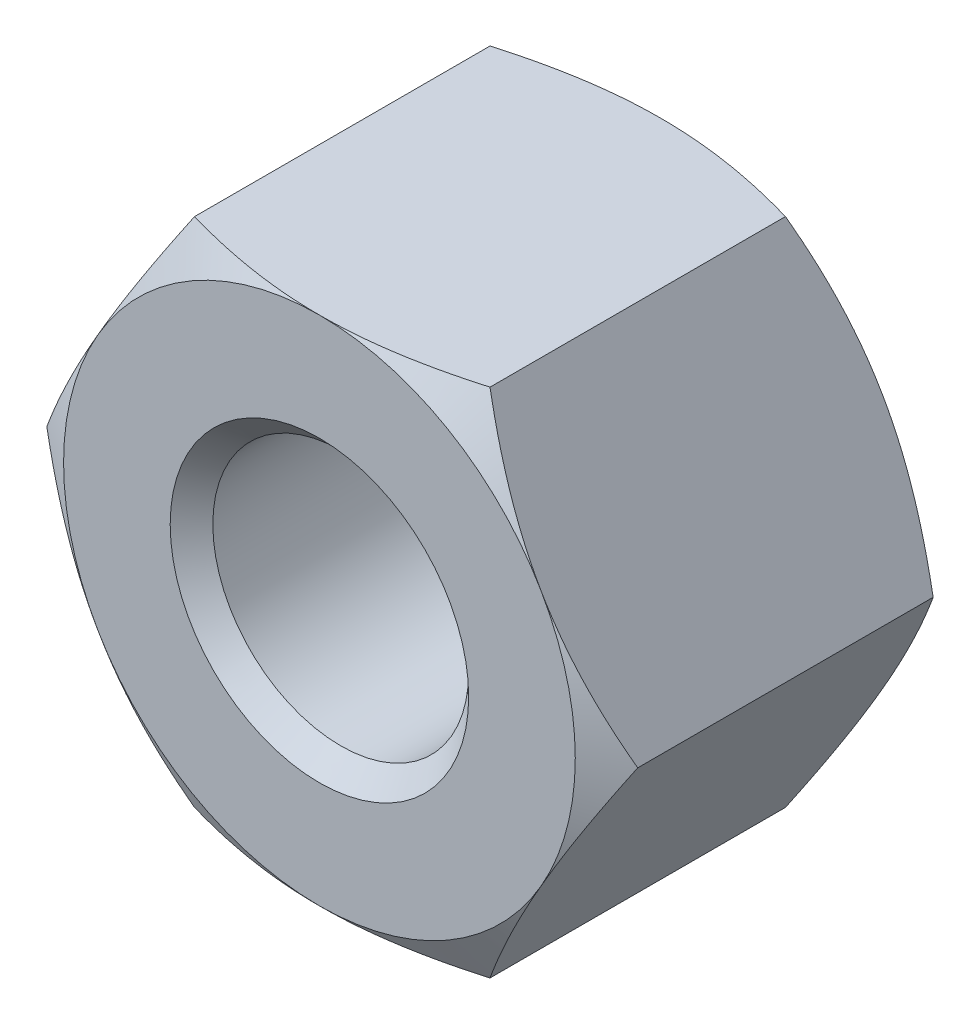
from build123d import *

# Parameters (mm, degrees)
BOSS_EXTRUDE1_DEPTH      = 2
SKETCH2_OUTSIDE_W        = 31.588
SKETCH2_OUTSIDE_H        = 30.66
SKETCH2_OUTSIDE_R        = 3
CUT_EXTRUDE1_DEPTH       = 6
CUT_EXTRUDE1_DRAFT       = -60
SKETCH3_R                = 1.5
SKETCH3_R_2              = 1.25
CUT_EXTRUDE2_DEPTH       = 2
SKETCH3_2_R              = 1.25
CUT_EXTRUDE3_DEPTH       = 2.75
CHAMFER1_SIZE            = 0.25
MIRROR1_COPY_1_SKETCH_W  = 31.588
MIRROR1_COPY_1_SKETCH_H  = 30.66
MIRROR1_COPY_1_SKETCH_R  = 3
MIRROR1_COPY_1_DEPTH     = 6
MIRROR1_COPY_1_DRAFT     = -60
CHAMFER1_OF_MIRROR1_SIZE = 0.25


with BuildPart() as part:
    # Sketch1 → Boss-Extrude1 (new body)
    with BuildSketch(Plane.XY):
        Polygon((1.732050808, 3), (-1.732050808, 3), (-3.464101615, 0), (-1.732050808, -3), (1.732050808, -3), (3.464101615, 0), align=None)
    boss_extrude1 = extrude(amount=-BOSS_EXTRUDE1_DEPTH)


with BuildPart() as cut_extrude1_tool:
    # Sketch2 outside → Cut-Extrude1 (with draft: the straight prism first)
    with BuildSketch(Plane(origin=(0, 0, -2), x_dir=(-1, 0, 0), z_dir=(0, 0, -1))):
        Rectangle(SKETCH2_OUTSIDE_W, SKETCH2_OUTSIDE_H)
        Circle(SKETCH2_OUTSIDE_R, mode=Mode.SUBTRACT)
    extrude(amount=-CUT_EXTRUDE1_DEPTH)
    # Cut-Extrude1: the draft: its side faces are tilted about the plane it starts from
    cut_extrude1_sides = [cut_extrude1_tool.faces().sort_by_distance(p)[0] for p in [
        (0, -15.33, 1),
        (-15.794, 0, 1),
        (0, 15.33, 1),
        (15.794, 0, 1),
        (3, 0, 1),
    ]]
    draft(cut_extrude1_sides, Plane(origin=(0, 0, -2), x_dir=(-1, 0, 0), z_dir=(0, 0, -1)), CUT_EXTRUDE1_DRAFT)


with BuildPart() as part_1:
    add(part.part)

    # Cut-Extrude1: cut by cut_extrude1_tool
    add(cut_extrude1_tool.part, mode=Mode.SUBTRACT)

    # Sketch3 → Cut-Extrude2 (cut)
    with BuildSketch(Plane(origin=(0, 0, -2), x_dir=(-1, 0, 0), z_dir=(0, 0, -1))):
        Circle(SKETCH3_R)
        Circle(SKETCH3_R_2, mode=Mode.SUBTRACT)
    cut_extrude2 = extrude(amount=-CUT_EXTRUDE2_DEPTH, mode=Mode.SUBTRACT)


with BuildPart() as cut_extrude2_piece_1:
    # of the separate pieces the step leaves, piece 1, a body of its own (cut_extrude2_pieces)
    add(part_1.part.solids().sort_by_distance((1.732050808, 3, 0))[0])

    # Chamfer1
    chamfer1_edges = [cut_extrude2_piece_1.edges().sort_by_distance(p)[0] for p in [
        (1.5, 0, -2),
    ]]
    chamfer(chamfer1_edges, length=CHAMFER1_SIZE)


with BuildPart() as cut_extrude2_piece_2:
    # of the separate pieces the step leaves, piece 2, a body of its own (cut_extrude2_pieces)
    add(part_1.part.solids().sort_by_distance((-1.25, 0, 0))[0])

    # Sketch3_2 → Cut-Extrude3 (cut)
    with BuildSketch(Plane(origin=(0, 0, -2), x_dir=(-1, 0, 0), z_dir=(0, 0, -1))):
        Circle(SKETCH3_2_R)
    cut_extrude3 = extrude(amount=-CUT_EXTRUDE3_DEPTH, mode=Mode.SUBTRACT)


with BuildPart() as cut_extrude2_piece_1_1:
    add(cut_extrude2_piece_1.part)

    # Mirror1: Boss-Extrude1, Cut-Extrude2, Cut-Extrude3 across plane
    add(boss_extrude1.mirror(Plane.XY))
    add(cut_extrude2.mirror(Plane.XY), mode=Mode.SUBTRACT)
    add(cut_extrude3.mirror(Plane.XY), mode=Mode.SUBTRACT)


with BuildPart() as mirror1_copy_1_tool:
    # Mirror1 copy 1 sketch → Mirror1 copy 1 (with draft: the straight prism first)
    with BuildSketch(Plane(origin=(0, 0, 2), x_dir=(-1, 0, 0), z_dir=(0, 0, 1))):
        Rectangle(MIRROR1_COPY_1_SKETCH_W, MIRROR1_COPY_1_SKETCH_H)
        Circle(MIRROR1_COPY_1_SKETCH_R, mode=Mode.SUBTRACT)
    extrude(amount=-MIRROR1_COPY_1_DEPTH)
    # Mirror1 copy 1: the draft: its side faces are tilted about the plane it starts from
    mirror1_copy_1_sides = [mirror1_copy_1_tool.faces().sort_by_distance(p)[0] for p in [
        (0, -15.33, -1),
        (-15.794, 0, -1),
        (0, 15.33, -1),
        (15.794, 0, -1),
        (3, 0, -1),
    ]]
    draft(mirror1_copy_1_sides, Plane(origin=(0, 0, 2), x_dir=(-1, 0, 0), z_dir=(0, 0, 1)), MIRROR1_COPY_1_DRAFT)


with BuildPart() as cut_extrude2_piece_1_2:
    add(cut_extrude2_piece_1_1.part)

    # Mirror1 copy 1: cut by mirror1_copy_1_tool
    add(mirror1_copy_1_tool.part, mode=Mode.SUBTRACT)

    # Chamfer1 of Mirror1
    chamfer1_of_mirror1_edges = [cut_extrude2_piece_1_2.edges().sort_by_distance(p)[0] for p in [
        (1.5, 0, 2),
    ]]
    chamfer(chamfer1_of_mirror1_edges, length=CHAMFER1_OF_MIRROR1_SIZE)


solid = cut_extrude2_piece_1_2.part
